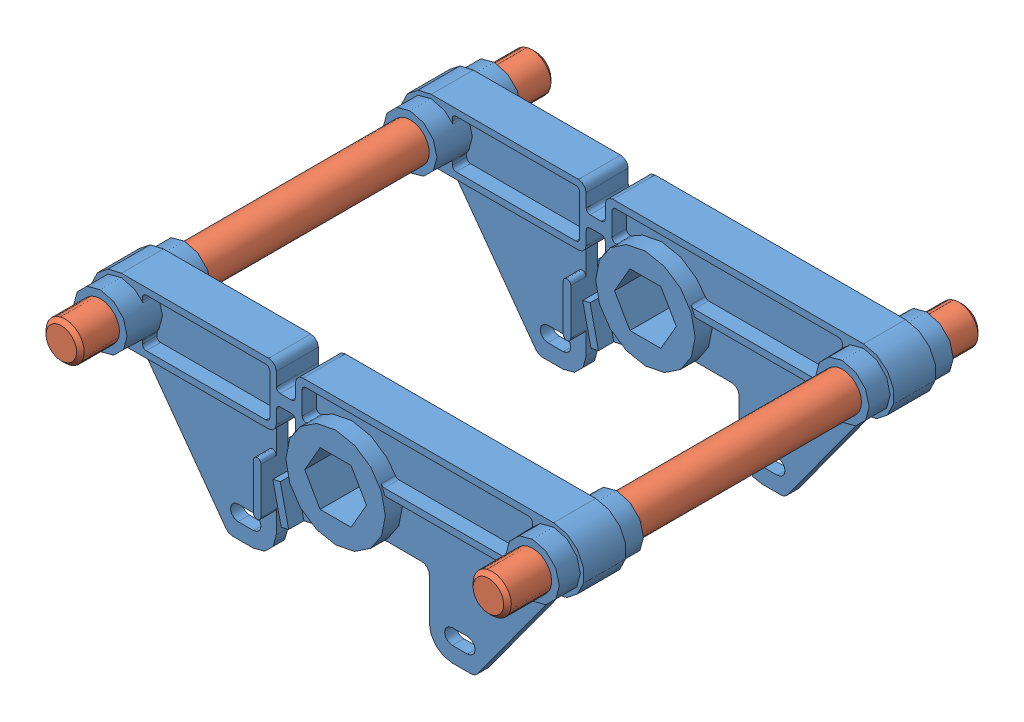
SolidWorks assembly Support flexible.SLDASM, configuration Défaut (file format 11000). Lengths in mm.
Overall size (129 49 125.34).
4 component instances, 2 part files, 9 mates.
Components (placement in the parent):
- levier-1: levier.SLDPRT [Défaut] at origin size (129 49 22)
- levier-2: levier.SLDPRT [Défaut] at (0 0 -81) size (129 49 22)
- Tige-1: Tige.SLDPRT [Défaut] at (56.5 12 -101.4503) x (0.968859 -0.247612 0) z (0 0 1) size (10 10 124)
- Tige-2: Tige.SLDPRT [Défaut] at (-56.5 12 -102.79) x (0.969198 0.246282 0) z (0 0 1) size (10 10 124)
Mates (geometry in assembly coordinates):
- Coaxial1: concentric: cylinder of levier-1 through (-56.5 12 -11) axis (0 0 1) radius 5; cylinder of levier-2 through (-56.5 12 -92) axis (0 0 1) radius 5
- Coïncidente1: coincident: plane of levier-1; plane of assembly
- Coïncidente2: coincident: plane of levier-1; plane of assembly
- Coïncidente3: coincident: point of levier-1; point of assembly
- Coaxial2: concentric: cylinder of levier-1 through (0 0 6) axis (0 0 -1) radius 13; cylinder of levier-2 through (0 0 -75) axis (0 0 -1) radius 13
- Coïncidente4: coincident: plane of levier-1 through (-16 20 5.5) normal (0 1 0); plane of levier-2 through (-16 20 -75.5) normal (0 1 0)
- Coaxial3: concentric: cylinder of levier-1 through (-56.5 12 -11) axis (0 0 1) radius 5; cylinder of Tige-2 through (-56.5 12 21.21) axis (0 0 -1) radius 5
- Coaxial4: concentric: cylinder of levier-1 through (56.5 12 -11) axis (0 0 1) radius 5; cylinder of Tige-1 through (56.5 12 22.5497) axis (0 0 -1) radius 5
- Distance1: distance = 70 mm: plane of levier-1 through (56.5 12 -5.5) normal (0 0 -1); plane of levier-2 through (56.5 12 -75.5) normal (0 0 1)
